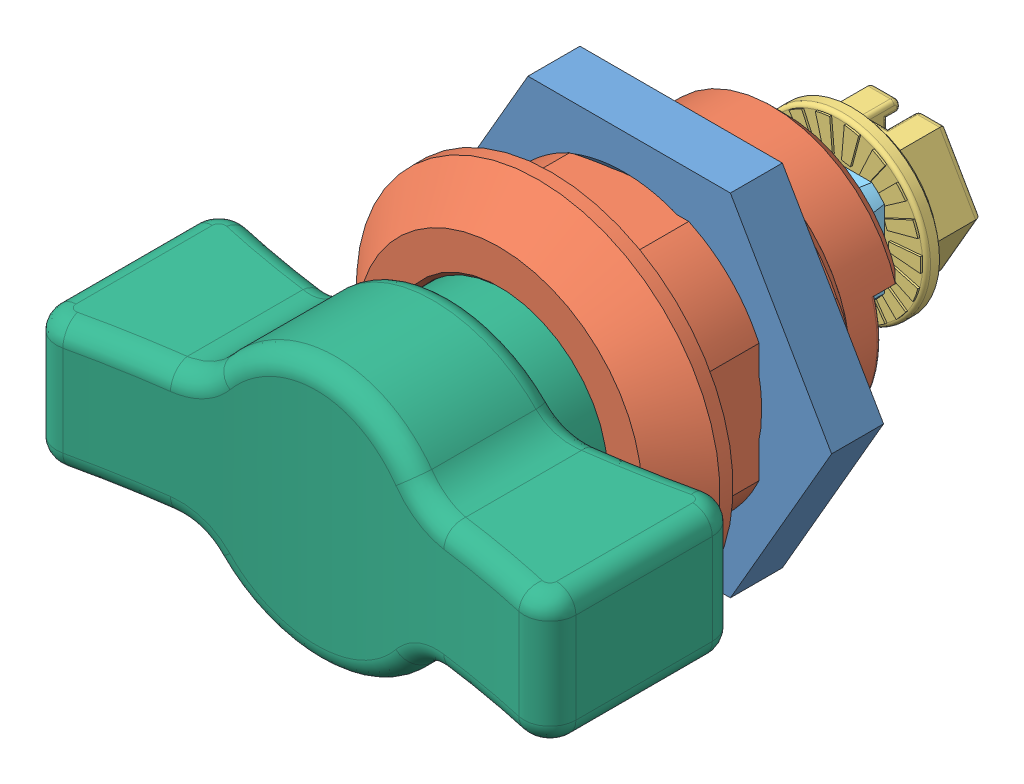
SolidWorks assembly 21.9301 T-Handle 8.sldasm, configuration Default (file format 3800). Lengths in mm.
Overall size (40 28 47.77).
9 component instances, 6 part files, 2 mates.
Components (placement in the parent):
- 1000-U45_ASM-1: 1000-U45_ASM.sldasm [Default] x (-1 0 0) z (0 0 1) size (31.18 28 22)
  - 1000-02-1: 1000-02.sldprt [Default] at (0 0 -10) x (-1 0 0) z (0 1 0) size (31.18 4.57 27)
  - 1000-101_PRT-1: 1000-101_PRT.sldprt [Default] x (-1 0 0) z (0 1 0) size (28 22 28)
- 1000-U78_ASM-1: 1000-U78_ASM.sldasm [Default] at (30.1499 -2.0695 -8.24) size (40 21.37 47.77)
  - 1000-277-01_PRT-1: 1000-277-01_PRT.sldprt [Default] at (-30.1499 2.0695 -13.91) x (0 0 -1) z (0 1 0) size (15.52 13.5 13.5)
  - 1000-03_PRT-1: 1000-03_PRT.sldprt [Default] at (-30.1499 2.0695 -4.36) x (-0.779545 -0.626346 0) z (-0.626346 0.779545 0) size (15.2 2.68 15.2)
  - 1000-129_ASM-1: 1000-129_ASM.sldasm [Default] at (-30.1499 2.0695 21.0903) size (40 20.07 41.8)
    - 1000-128_PRT-1: 1000-128_PRT.sldprt [Default] at (0 0 -20.9503) x (0 0 1) z (-1 0 0) size (36 16 16)
    - 1000-129_PRT-1: 1000-129_PRT.sldprt [Default] x (-1 0 0) z (0 1 0) size (40 17.5 20.07)
Mates (geometry in assembly coordinates):
- Concentric1: concentric anti-aligned: cylinder of 1000-U45_ASM-1/1000-101_PRT-1; cylinder of 1000-U78_ASM-1/1000-129_ASM-1/1000-128_PRT-1
- Coincident1: coincident aligned: plane of 1000-U45_ASM-1/1000-101_PRT-1 through (0 0 -18) normal (0 0 -1); plane of 1000-U78_ASM-1/1000-129_ASM-1/1000-128_PRT-1 through (-9.6 4.2 -18) normal (0 0 -1)
